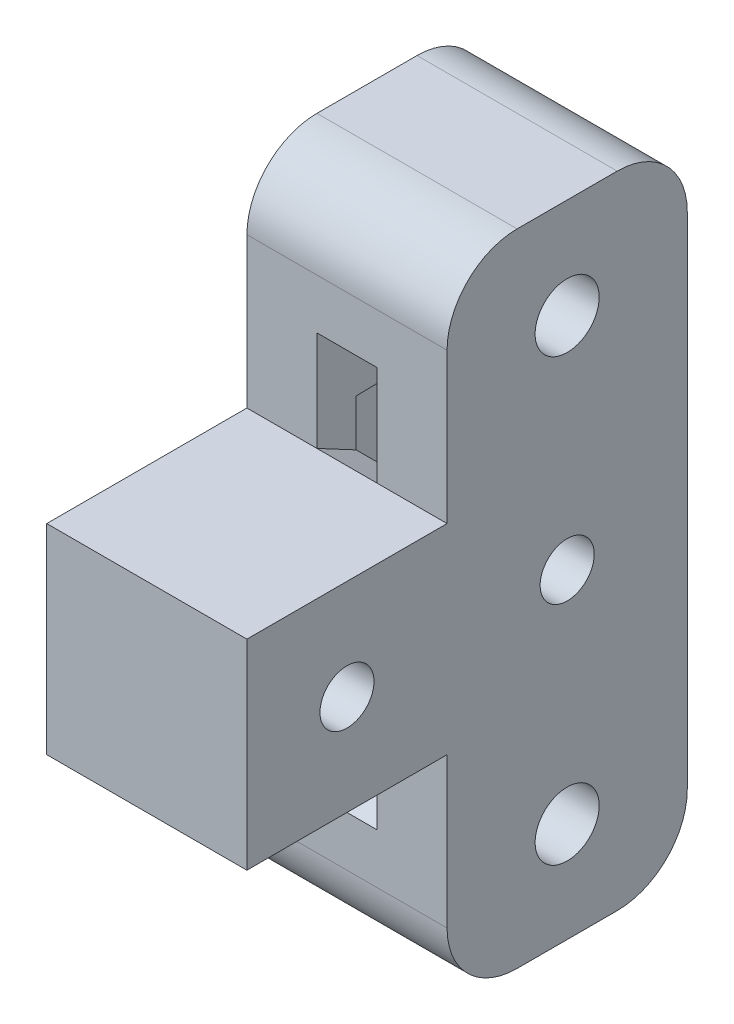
from build123d import *

# Parameters (mm, degrees)
SKETCH_1_R          = 2.7
SKETCH_1_R_2        = 3.2
EXTRUDE_1_DEPTH     = 10
SKETCH_7_W          = 10
SKETCH_7_H          = 25
CUT_EXTRUDE_3_DEPTH = 20
FILLET_3_R          = 7


with BuildPart() as part:
    # Sketch 1 → Extrude 1 (new, symmetric)
    with BuildSketch(Plane.YZ):
        Polygon((-24.746355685, 0), (-24.746355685, -24), (39.253644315, -24), (39.253644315, 0), (17.253644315, 0), (17.253644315, 20), (-2.746355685, 20), (-2.746355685, 0), align=None)
        with Locations(Location((7.253644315, -12, 0), (0, 0, 270))):
            Circle(SKETCH_1_R, mode=Mode.SUBTRACT)
        with Locations(Location((29.253644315, -12, 0), (0, 0, 270))):
            Circle(SKETCH_1_R_2, mode=Mode.SUBTRACT)
        with Locations(Location((-14.746355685, -12, 0), (0, 0, 270))):
            Circle(SKETCH_1_R_2, mode=Mode.SUBTRACT)
        with Locations(Location((7.253644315, 10, 0), (0, 0, 270))):
            Circle(SKETCH_1_R, mode=Mode.SUBTRACT)
    extrude(amount=EXTRUDE_1_DEPTH, both=True)

    # Sketch 2 → Loft 1 section 0
    with BuildSketch(Plane.XY):
        with BuildLine():
            Line((-3, -12.746355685), (3, -12.746355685))
            Line((3, -12.746355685), (3, -2.746355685))
            Line((3, -2.746355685), (-3, -2.746355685))
            Line((-3, -2.746355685), (-3, -12.746355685))
        make_face()
    # Sketch 4 → Loft 1 section 1
    with BuildSketch(Plane(origin=(0, 0, -24), x_dir=(1, 0, 0), z_dir=(0, 0, -1))):
        with BuildLine():
            Line((-3.5, -4.253644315), (3.5, -4.253644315))
            Line((3.5, -4.253644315), (3.5, -14.253644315))
            Line((3.5, -14.253644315), (-3.5, -14.253644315))
            Line((-3.5, -14.253644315), (-3.5, -4.253644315))
        make_face()
    loft(mode=Mode.SUBTRACT)

    # Sketch 6 → Loft 2 section 0
    with BuildSketch(Plane(origin=(0, 0, -24), x_dir=(1, 0, 0), z_dir=(0, 0, -1))):
        with BuildLine():
            Line((-3.5, -4.253644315), (3.5, -4.253644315))
            Line((3.5, -4.253644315), (3.5, -14.253644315))
            Line((3.5, -14.253644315), (-3.5, -14.253644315))
            Line((-3.5, -14.253644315), (-3.5, -4.253644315))
        make_face()
    # Sketch 3 → Loft 2 section 1
    with BuildSketch(Plane.XY):
        with BuildLine():
            Line((-3, 27.253644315), (3, 27.253644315))
            Line((3, 27.253644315), (3, 17.253644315))
            Line((3, 17.253644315), (-3, 17.253644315))
            Line((-3, 17.253644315), (-3, 27.253644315))
        make_face()
    loft(mode=Mode.SUBTRACT)

    # Sketch 7 → Cut-Extrude 3 (cut)
    with BuildSketch(Plane(origin=(0, 0, -24), x_dir=(1, 0, 0), z_dir=(0, 0, -1))):
        with Locations((0, -7.253644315)):
            Rectangle(SKETCH_7_W, SKETCH_7_H)
    extrude(amount=-CUT_EXTRUDE_3_DEPTH, mode=Mode.SUBTRACT)

    # Fillet 3
    fillet_3_edges = [part.edges().sort_by_distance(p)[0] for p in [
        (0, 39.253644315, 0),
        (0, 39.253644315, -24),
        (0, -24.746355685, -24),
        (0, -24.746355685, 0),
    ]]
    fillet(fillet_3_edges, radius=FILLET_3_R)


solid = part.part
